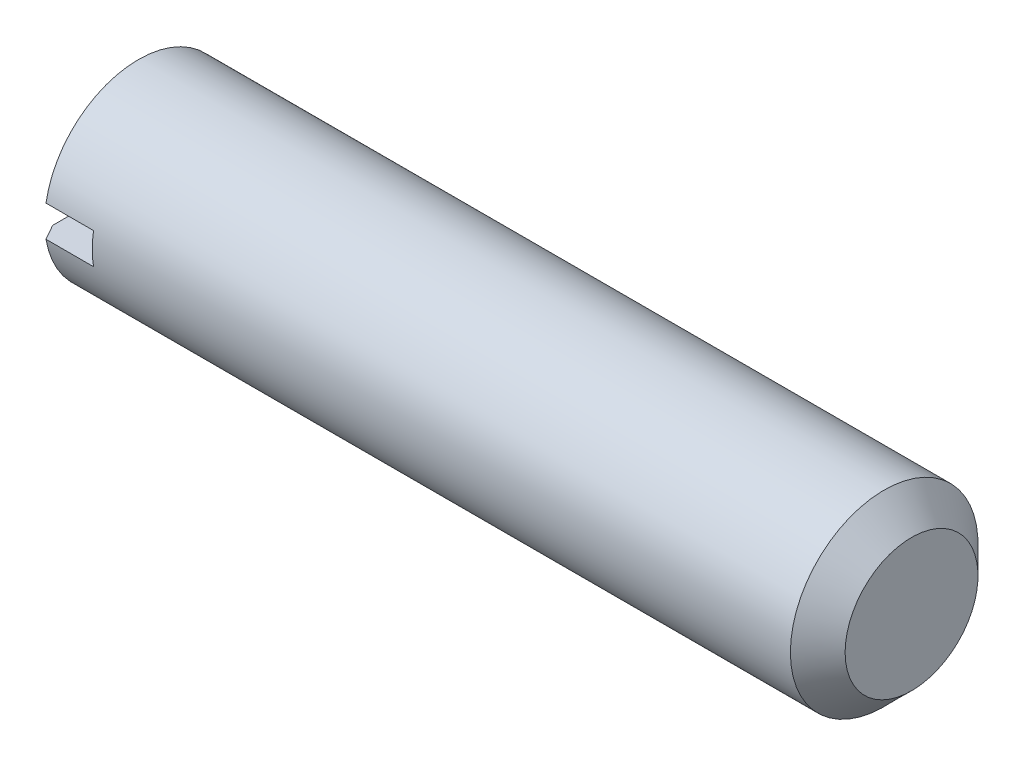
from build123d import *

# Parameters (mm, degrees)
SKETCH2_W  = 12
SKETCH2_H  = 2
SLOT_DEPTH = 3.6


with BuildPart() as part:
    # BodySke → BaseBody (revolve)
    with BuildSketch(Plane.XY, mode=Mode.PRIVATE) as basebody_sk:
        Polygon((50, 0), (50, 4.25), (48.25, 6), (0.556565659, 6), (0, 5.036), (0, 0), align=None)
    revolve(basebody_sk.sketch.rotate(Axis((50, 0, 0), (1, 0, 0)), 90), axis=Axis((50, 0, 0), (1, 0, 0)))

    # Sketch2 → Slot (cut)
    with BuildSketch(Plane(origin=(0, 0, 0), x_dir=(0, 0, -1), z_dir=(1, 0, 0))):
        Rectangle(SKETCH2_W, SKETCH2_H)
    extrude(amount=SLOT_DEPTH, mode=Mode.SUBTRACT)


solid = part.part
